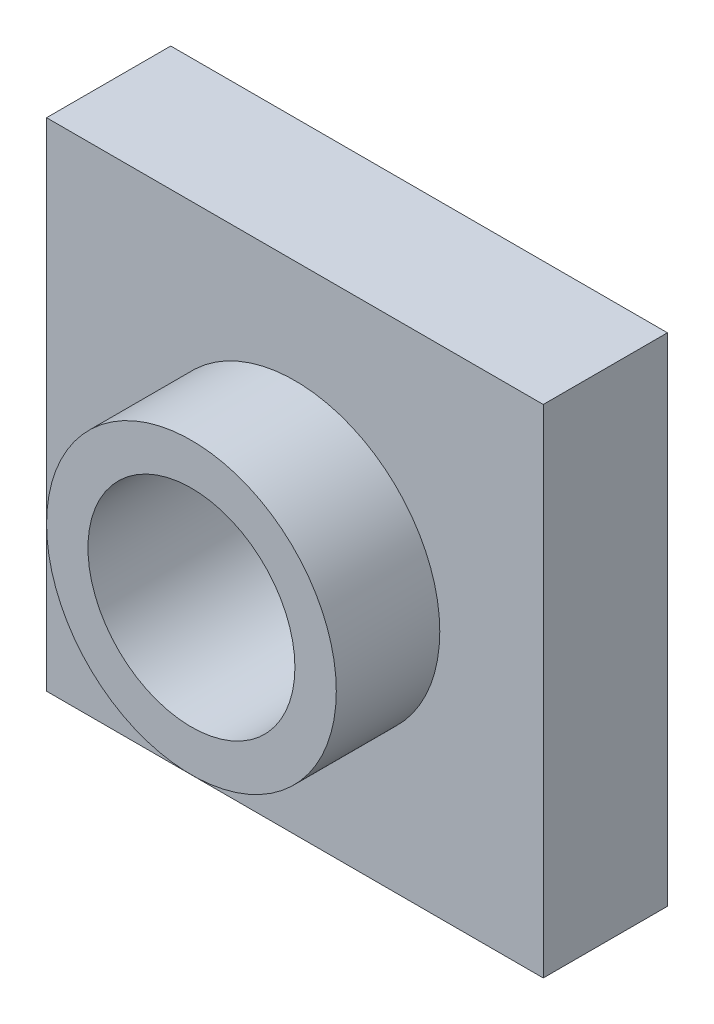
ISO-10303-21;
HEADER;
FILE_DESCRIPTION(('STEP AP214'),'2;1');
FILE_NAME('part.step','',(''),(''),'','','');
FILE_SCHEMA(('AUTOMOTIVE_DESIGN { 1 0 10303 214 1 1 1 1 }'));
ENDSEC;
DATA;
#1=APPLICATION_CONTEXT('core data for automotive mechanical design processes');
#2=APPLICATION_PROTOCOL_DEFINITION('international standard','automotive_design',2000,#1);
#3=PRODUCT_CONTEXT('',#1,'mechanical');
#4=PRODUCT('Part','Part','',(#3));
#5=PRODUCT_RELATED_PRODUCT_CATEGORY('part','',(#4));
#6=PRODUCT_DEFINITION_FORMATION('','',#4);
#7=PRODUCT_DEFINITION_CONTEXT('part definition',#1,'design');
#8=PRODUCT_DEFINITION('design','',#6,#7);
#9=PRODUCT_DEFINITION_SHAPE('','',#8);
#10=(LENGTH_UNIT() NAMED_UNIT(*) SI_UNIT(.MILLI.,.METRE.));
#11=(NAMED_UNIT(*) PLANE_ANGLE_UNIT() SI_UNIT($,.RADIAN.));
#12=(NAMED_UNIT(*) SI_UNIT($,.STERADIAN.) SOLID_ANGLE_UNIT());
#13=UNCERTAINTY_MEASURE_WITH_UNIT(LENGTH_MEASURE(1.E-05),#10,'distance_accuracy_value','');
#14=(GEOMETRIC_REPRESENTATION_CONTEXT(3) GLOBAL_UNCERTAINTY_ASSIGNED_CONTEXT((#13)) GLOBAL_UNIT_ASSIGNED_CONTEXT((#10,
#11,#12)) REPRESENTATION_CONTEXT('',''));
#15=CARTESIAN_POINT('',(0.,0.,0.));
#16=DIRECTION('',(0.,0.,1.));
#17=DIRECTION('',(1.,0.,0.));
#18=AXIS2_PLACEMENT_3D('',#15,#16,#17);
#19=CARTESIAN_POINT('',(0.,120.,30.));
#20=DIRECTION('',(0.,0.,-1.));
#21=DIRECTION('',(-1.,0.,0.));
#22=AXIS2_PLACEMENT_3D('',#19,#20,#21);
#23=PLANE('',#22);
#24=DIRECTION('',(0.,-1.,0.));
#25=VECTOR('',#24,1.);
#26=CARTESIAN_POINT('',(0.,0.,30.));
#27=LINE('',#26,#25);
#28=CARTESIAN_POINT('',(0.,120.,30.));
#29=VERTEX_POINT('',#28);
#30=CARTESIAN_POINT('',(0.,0.,30.));
#31=VERTEX_POINT('',#30);
#32=EDGE_CURVE('E83',#29,#31,#27,.T.);
#33=ORIENTED_EDGE('',*,*,#32,.T.);
#34=DIRECTION('',(1.,0.,0.));
#35=VECTOR('',#34,1.);
#36=CARTESIAN_POINT('',(0.,0.,30.));
#37=LINE('',#36,#35);
#38=CARTESIAN_POINT('',(120.,0.,30.));
#39=VERTEX_POINT('',#38);
#40=EDGE_CURVE('E78',#31,#39,#37,.T.);
#41=ORIENTED_EDGE('',*,*,#40,.T.);
#42=DIRECTION('',(0.,1.,0.));
#43=VECTOR('',#42,1.);
#44=CARTESIAN_POINT('',(120.,0.,30.));
#45=LINE('',#44,#43);
#46=CARTESIAN_POINT('',(120.,120.,30.));
#47=VERTEX_POINT('',#46);
#48=EDGE_CURVE('E81',#39,#47,#45,.T.);
#49=ORIENTED_EDGE('',*,*,#48,.T.);
#50=DIRECTION('',(-1.,0.,0.));
#51=VECTOR('',#50,1.);
#52=CARTESIAN_POINT('',(0.,120.,30.));
#53=LINE('',#52,#51);
#54=EDGE_CURVE('E47',#47,#29,#53,.T.);
#55=ORIENTED_EDGE('',*,*,#54,.T.);
#56=EDGE_LOOP('',(#33,#41,#49,#55));
#57=FACE_BOUND('',#56,.T.);
#58=CARTESIAN_POINT('',(60.,60.,30.));
#59=DIRECTION('',(0.,0.,-1.));
#60=DIRECTION('',(-1.,0.,0.));
#61=AXIS2_PLACEMENT_3D('',#58,#59,#60);
#62=CIRCLE('',#61,35.);
#63=CARTESIAN_POINT('',(24.9999999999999,60.,30.));
#64=VERTEX_POINT('',#63);
#65=EDGE_CURVE('E11',#64,#64,#62,.F.);
#66=ORIENTED_EDGE('',*,*,#65,.F.);
#67=EDGE_LOOP('',(#66));
#68=FACE_BOUND('',#67,.T.);
#69=ADVANCED_FACE('F30',(#57,#68),#23,.F.);
#70=CARTESIAN_POINT('',(0.,0.,30.));
#71=DIRECTION('',(1.,0.,0.));
#72=DIRECTION('',(0.,1.,0.));
#73=AXIS2_PLACEMENT_3D('',#70,#71,#72);
#74=PLANE('',#73);
#75=DIRECTION('',(0.,-1.,0.));
#76=VECTOR('',#75,1.);
#77=CARTESIAN_POINT('',(0.,0.,0.));
#78=LINE('',#77,#76);
#79=CARTESIAN_POINT('',(0.,120.,0.));
#80=VERTEX_POINT('',#79);
#81=CARTESIAN_POINT('',(0.,0.,0.));
#82=VERTEX_POINT('',#81);
#83=EDGE_CURVE('E97',#80,#82,#78,.T.);
#84=ORIENTED_EDGE('',*,*,#83,.T.);
#85=DIRECTION('',(0.,0.,-1.));
#86=VECTOR('',#85,1.);
#87=CARTESIAN_POINT('',(0.,0.,30.));
#88=LINE('',#87,#86);
#89=EDGE_CURVE('E39',#31,#82,#88,.T.);
#90=ORIENTED_EDGE('',*,*,#89,.F.);
#91=ORIENTED_EDGE('',*,*,#32,.F.);
#92=DIRECTION('',(0.,0.,-1.));
#93=VECTOR('',#92,1.);
#94=CARTESIAN_POINT('',(0.,120.,30.));
#95=LINE('',#94,#93);
#96=EDGE_CURVE('E93',#29,#80,#95,.T.);
#97=ORIENTED_EDGE('',*,*,#96,.T.);
#98=EDGE_LOOP('',(#84,#90,#91,#97));
#99=FACE_BOUND('',#98,.T.);
#100=ADVANCED_FACE('F32',(#99),#74,.F.);
#101=CARTESIAN_POINT('',(0.,0.,30.));
#102=DIRECTION('',(0.,1.,0.));
#103=DIRECTION('',(0.,0.,1.));
#104=AXIS2_PLACEMENT_3D('',#101,#102,#103);
#105=PLANE('',#104);
#106=DIRECTION('',(1.,0.,0.));
#107=VECTOR('',#106,1.);
#108=CARTESIAN_POINT('',(0.,0.,0.));
#109=LINE('',#108,#107);
#110=CARTESIAN_POINT('',(120.,0.,0.));
#111=VERTEX_POINT('',#110);
#112=EDGE_CURVE('E88',#82,#111,#109,.T.);
#113=ORIENTED_EDGE('',*,*,#112,.T.);
#114=DIRECTION('',(0.,0.,-1.));
#115=VECTOR('',#114,1.);
#116=CARTESIAN_POINT('',(120.,0.,30.));
#117=LINE('',#116,#115);
#118=EDGE_CURVE('E86',#39,#111,#117,.T.);
#119=ORIENTED_EDGE('',*,*,#118,.F.);
#120=ORIENTED_EDGE('',*,*,#40,.F.);
#121=ORIENTED_EDGE('',*,*,#89,.T.);
#122=EDGE_LOOP('',(#113,#119,#120,#121));
#123=FACE_BOUND('',#122,.T.);
#124=ADVANCED_FACE('F87',(#123),#105,.F.);
#125=CARTESIAN_POINT('',(120.,0.,30.));
#126=DIRECTION('',(-1.,0.,0.));
#127=DIRECTION('',(0.,-1.,0.));
#128=AXIS2_PLACEMENT_3D('',#125,#126,#127);
#129=PLANE('',#128);
#130=DIRECTION('',(0.,1.,0.));
#131=VECTOR('',#130,1.);
#132=CARTESIAN_POINT('',(120.,0.,0.));
#133=LINE('',#132,#131);
#134=CARTESIAN_POINT('',(120.,120.,0.));
#135=VERTEX_POINT('',#134);
#136=EDGE_CURVE('E64',#111,#135,#133,.T.);
#137=ORIENTED_EDGE('',*,*,#136,.T.);
#138=DIRECTION('',(0.,0.,-1.));
#139=VECTOR('',#138,1.);
#140=CARTESIAN_POINT('',(120.,120.,30.));
#141=LINE('',#140,#139);
#142=EDGE_CURVE('E89',#47,#135,#141,.T.);
#143=ORIENTED_EDGE('',*,*,#142,.F.);
#144=ORIENTED_EDGE('',*,*,#48,.F.);
#145=ORIENTED_EDGE('',*,*,#118,.T.);
#146=EDGE_LOOP('',(#137,#143,#144,#145));
#147=FACE_BOUND('',#146,.T.);
#148=ADVANCED_FACE('F91',(#147),#129,.F.);
#149=CARTESIAN_POINT('',(0.,120.,30.));
#150=DIRECTION('',(0.,-1.,0.));
#151=DIRECTION('',(0.,0.,-1.));
#152=AXIS2_PLACEMENT_3D('',#149,#150,#151);
#153=PLANE('',#152);
#154=DIRECTION('',(-1.,0.,0.));
#155=VECTOR('',#154,1.);
#156=CARTESIAN_POINT('',(0.,120.,0.));
#157=LINE('',#156,#155);
#158=EDGE_CURVE('E70',#135,#80,#157,.T.);
#159=ORIENTED_EDGE('',*,*,#158,.T.);
#160=ORIENTED_EDGE('',*,*,#96,.F.);
#161=ORIENTED_EDGE('',*,*,#54,.F.);
#162=ORIENTED_EDGE('',*,*,#142,.T.);
#163=EDGE_LOOP('',(#159,#160,#161,#162));
#164=FACE_BOUND('',#163,.T.);
#165=ADVANCED_FACE('F111',(#164),#153,.F.);
#166=CARTESIAN_POINT('',(0.,120.,0.));
#167=DIRECTION('',(0.,0.,-1.));
#168=DIRECTION('',(-1.,0.,0.));
#169=AXIS2_PLACEMENT_3D('',#166,#167,#168);
#170=PLANE('',#169);
#171=CARTESIAN_POINT('',(60.,60.,0.));
#172=DIRECTION('',(0.,0.,1.));
#173=DIRECTION('',(1.,0.,0.));
#174=AXIS2_PLACEMENT_3D('',#171,#172,#173);
#175=CIRCLE('',#174,25.);
#176=CARTESIAN_POINT('',(85.,60.,0.));
#177=VERTEX_POINT('',#176);
#178=EDGE_CURVE('E139',#177,#177,#175,.T.);
#179=ORIENTED_EDGE('',*,*,#178,.T.);
#180=EDGE_LOOP('',(#179));
#181=FACE_BOUND('',#180,.T.);
#182=ORIENTED_EDGE('',*,*,#83,.F.);
#183=ORIENTED_EDGE('',*,*,#158,.F.);
#184=ORIENTED_EDGE('',*,*,#136,.F.);
#185=ORIENTED_EDGE('',*,*,#112,.F.);
#186=EDGE_LOOP('',(#182,#183,#184,#185));
#187=FACE_BOUND('',#186,.T.);
#188=ADVANCED_FACE('F108',(#181,#187),#170,.T.);
#189=CARTESIAN_POINT('',(60.,60.,55.));
#190=DIRECTION('',(0.,0.,-1.));
#191=DIRECTION('',(-1.,0.,0.));
#192=AXIS2_PLACEMENT_3D('',#189,#190,#191);
#193=CYLINDRICAL_SURFACE('',#192,35.);
#194=CARTESIAN_POINT('',(60.,60.,55.));
#195=DIRECTION('',(0.,0.,1.));
#196=DIRECTION('',(1.,0.,0.));
#197=AXIS2_PLACEMENT_3D('',#194,#195,#196);
#198=CIRCLE('',#197,35.);
#199=CARTESIAN_POINT('',(95.,60.,55.));
#200=VERTEX_POINT('',#199);
#201=EDGE_CURVE('E100',#200,#200,#198,.T.);
#202=ORIENTED_EDGE('',*,*,#201,.F.);
#203=EDGE_LOOP('',(#202));
#204=FACE_BOUND('',#203,.T.);
#205=ORIENTED_EDGE('',*,*,#65,.T.);
#206=EDGE_LOOP('',(#205));
#207=FACE_BOUND('',#206,.T.);
#208=ADVANCED_FACE('F110',(#204,#207),#193,.T.);
#209=CARTESIAN_POINT('',(60.,60.,55.));
#210=DIRECTION('',(0.,0.,1.));
#211=DIRECTION('',(1.,0.,0.));
#212=AXIS2_PLACEMENT_3D('',#209,#210,#211);
#213=PLANE('',#212);
#214=CARTESIAN_POINT('',(60.,60.,55.));
#215=DIRECTION('',(0.,0.,1.));
#216=DIRECTION('',(1.,0.,0.));
#217=AXIS2_PLACEMENT_3D('',#214,#215,#216);
#218=CIRCLE('',#217,25.);
#219=CARTESIAN_POINT('',(85.,60.,55.));
#220=VERTEX_POINT('',#219);
#221=EDGE_CURVE('E142',#220,#220,#218,.T.);
#222=ORIENTED_EDGE('',*,*,#221,.F.);
#223=EDGE_LOOP('',(#222));
#224=FACE_BOUND('',#223,.T.);
#225=ORIENTED_EDGE('',*,*,#201,.T.);
#226=EDGE_LOOP('',(#225));
#227=FACE_BOUND('',#226,.T.);
#228=ADVANCED_FACE('F118',(#224,#227),#213,.T.);
#229=CARTESIAN_POINT('',(60.,60.,0.));
#230=DIRECTION('',(0.,0.,1.));
#231=DIRECTION('',(1.,0.,0.));
#232=AXIS2_PLACEMENT_3D('',#229,#230,#231);
#233=CYLINDRICAL_SURFACE('',#232,25.);
#234=ORIENTED_EDGE('',*,*,#178,.F.);
#235=EDGE_LOOP('',(#234));
#236=FACE_BOUND('',#235,.T.);
#237=ORIENTED_EDGE('',*,*,#221,.T.);
#238=EDGE_LOOP('',(#237));
#239=FACE_BOUND('',#238,.T.);
#240=ADVANCED_FACE('F131',(#236,#239),#233,.F.);
#241=CLOSED_SHELL('',(#69,#100,#124,#148,#165,#188,#208,#228,#240));
#242=MANIFOLD_SOLID_BREP('B2',#241);
#243=ADVANCED_BREP_SHAPE_REPRESENTATION('',(#18,#242),#14);
#244=SHAPE_DEFINITION_REPRESENTATION(#9,#243);
ENDSEC;
END-ISO-10303-21;
